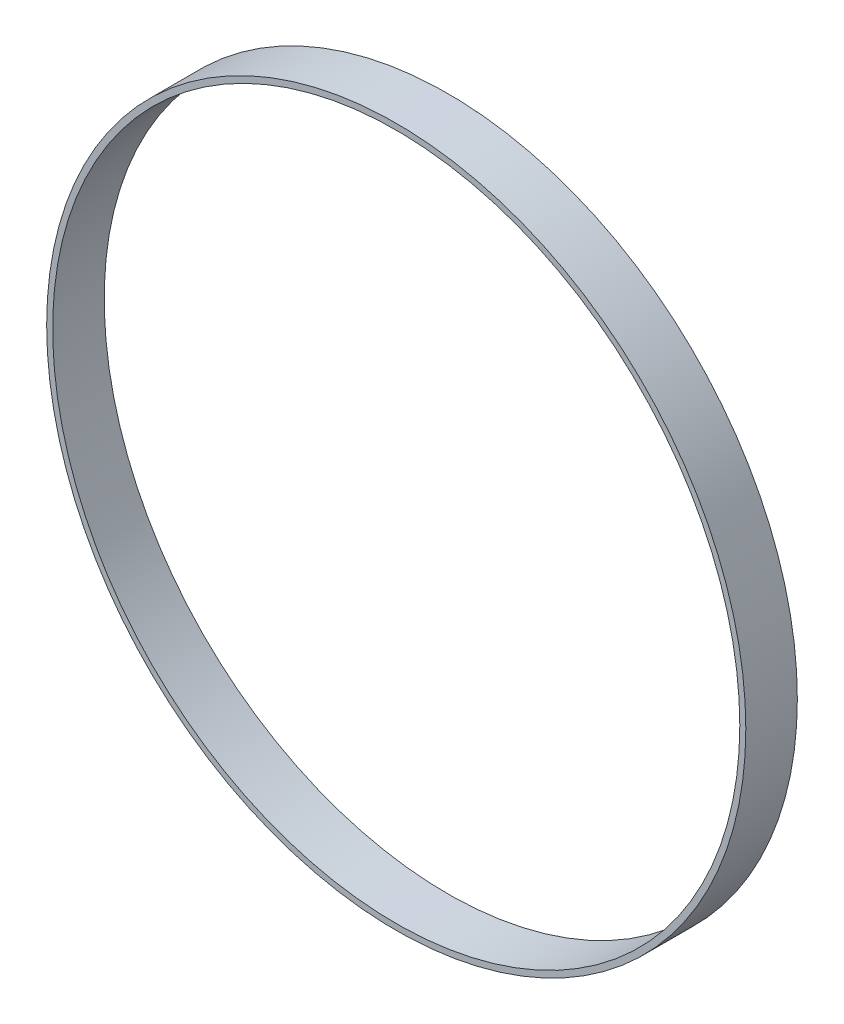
from build123d import *

# Parameters (mm, degrees)
ESQUISSE1_R      = 40.7
ESQUISSE1_R_2    = 40
EXTRUSION1_DEPTH = 6


with BuildPart() as part:
    # Esquisse1 → Extrusion1 (new body)
    with BuildSketch(Plane.XY):
        Circle(ESQUISSE1_R)
        Circle(ESQUISSE1_R_2, mode=Mode.SUBTRACT)
    extrude(amount=EXTRUSION1_DEPTH)


solid = part.part
